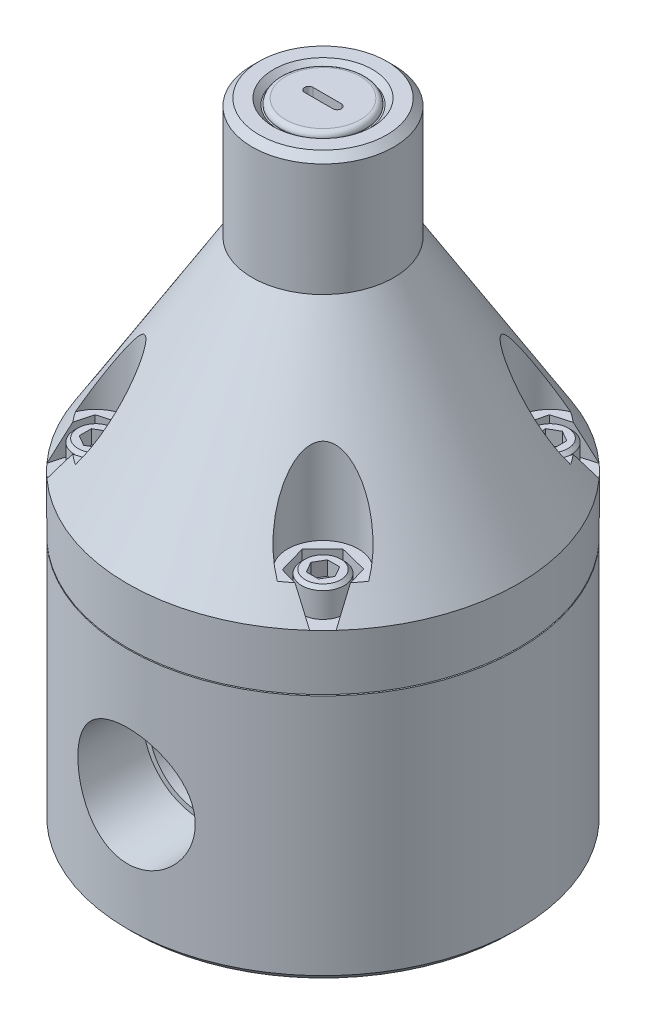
from build123d import *

# Parameters (mm, degrees)
SKETCH1_R         = 43.815
EXTRUDE1_DEPTH    = 140.97
SKETCH3_R         = 11.1125
EXTRUDE2_DEPTH    = 1.27
EXTRUDE2_DRAFT    = -45
CHAMFER1_SIZE     = 1.5748
SKETCH4_R         = 9.525
EXTRUDE3_DEPTH    = 1.27
FILLET1_R         = 1.143
EXTRUDE4_DEPTH    = 3.302
EXTRUDE4_DRAFT    = -1
SKETCH6_R         = 7.9375
EXTRUDE5_DEPTH    = 22.86
EXTRUDE6_DEPTH    = 6.35
CIRPATTERN1_COUNT = 4
SKETCH9_R         = 4.7625
EXTRUDE7_DEPTH    = 6.35
EXTRUDE8_DEPTH    = 3.175
CIRPATTERN2_COUNT = 4
CHAMFER2_SIZE     = 0.762


with BuildPart() as part:
    # Sketch1 → Extrude1 (new body)
    with BuildSketch(Plane(origin=(0, 0, 0), x_dir=(1, 0, 0), z_dir=(0, 1, 0))):
        with Locations(Location((0, 0, 0), (0, 0, 270))):
            Circle(SKETCH1_R)
    extrude(amount=EXTRUDE1_DEPTH)

    # Sketch2 → Cut-Revolve1 (revolve, cut)
    with BuildSketch(Plane.XY, mode=Mode.PRIVATE) as cut_revolve1_sk:
        Polygon((-43.815, 56.134), (-43.815, 68.58), (-15.875, 114.046), (-15.875, 147.034008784), (-49.44729897, 147.034008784), (-49.44729897, 55.88), (-30.226, 55.88), (-30.226, 56.134), align=None)
    revolve(cut_revolve1_sk.sketch.rotate(Axis((0, 0, 0), (0, 1, 0)), 270), axis=Axis((0, 0, 0), (0, 1, 0)), mode=Mode.SUBTRACT)


with BuildPart() as extrude2_tool:
    # Sketch3 → Extrude2 (with draft: the straight prism first)
    with BuildSketch(Plane(origin=(0, 140.97, 0), x_dir=(-1, 0, 0), z_dir=(0, 1, 0))):
        Circle(SKETCH3_R)
    extrude(amount=-EXTRUDE2_DEPTH)
    # Extrude2: the draft: its side faces are tilted about the plane it starts from
    extrude2_sides = [extrude2_tool.faces().sort_by_distance(p)[0] for p in [
        (11.1125, 140.335, 0),
    ]]
    draft(extrude2_sides, Plane(origin=(0, 140.97, 0), x_dir=(-1, 0, 0), z_dir=(0, 1, 0)), EXTRUDE2_DRAFT)


with BuildPart() as part_1:
    add(part.part)

    # Extrude2: cut by extrude2_tool
    add(extrude2_tool.part, mode=Mode.SUBTRACT)

    # Chamfer1
    chamfer1_edges = [part_1.edges().sort_by_distance(p)[0] for p in [
        (0, 0, -43.815),
        (0, 140.97, 15.875),
    ]]
    chamfer(chamfer1_edges, length=CHAMFER1_SIZE)

    # Sketch4 → Extrude3 (add)
    with BuildSketch(Plane(origin=(0, 140.97, 0), x_dir=(-1, 0, 0), z_dir=(0, 1, 0))):
        with Locations(Location((0, 0, 0), (0, 0, 90))):
            Circle(SKETCH4_R)
    extrude(amount=-EXTRUDE3_DEPTH)

    # Fillet1
    fillet1_edges = [part_1.edges().sort_by_distance(p)[0] for p in [
        (0, 140.97, -9.525),
    ]]
    fillet(fillet1_edges, radius=FILLET1_R)


with BuildPart() as extrude4_tool:
    # Sketch5 → Extrude4 (with draft: the straight prism first)
    with BuildSketch(Plane(origin=(0, 140.97, 0), x_dir=(-1, 0, 0), z_dir=(0, 1, 0))):
        with BuildLine():
            Line((3.175, 0.9652), (-3.175, 0.9652))
            ThreePointArc((-3.175, 0.9652), (-4.1402, 0), (-3.175, -0.9652))
            Line((-3.175, -0.9652), (3.175, -0.9652))
            ThreePointArc((3.175, -0.9652), (4.1402, 0), (3.175, 0.9652))
        make_face()
    extrude(amount=-EXTRUDE4_DEPTH)
    # Extrude4: the draft: its side faces are tilted about the plane it starts from
    extrude4_sides = [extrude4_tool.faces().sort_by_distance(p)[0] for p in [
        (-4.1402, 139.319, 0),
        (0, 139.319, 0.9652),
        (4.1402, 139.319, 0),
        (0, 139.319, -0.9652),
    ]]
    draft(extrude4_sides, Plane(origin=(0, 140.97, 0), x_dir=(-1, 0, 0), z_dir=(0, 1, 0)), EXTRUDE4_DRAFT)


with BuildPart() as part_2:
    add(part_1.part)

    # Extrude4: cut by extrude4_tool
    add(extrude4_tool.part, mode=Mode.SUBTRACT)

    # Sketch6 → Extrude5 (cut)
    with BuildSketch(Plane(origin=(0, 74.93, 0), x_dir=(-1, 0, 0), z_dir=(0, 1, 0))):
        with Locations((-25.459026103, 25.459026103)):
            Circle(SKETCH6_R)
    extrude5 = extrude(amount=EXTRUDE5_DEPTH, mode=Mode.SUBTRACT)

    # Sketch8 → Extrude6 (cut)
    with BuildSketch(Plane(origin=(0, 74.93, 0), x_dir=(-1, 0, 0), z_dir=(0, 1, 0))):
        Polygon((-29.948607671, 20.824591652), (-23.690278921, 19.253717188), (-19.200697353, 23.888151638), (-20.969444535, 30.093460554), (-33.591654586, 33.591654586), align=None)
    extrude6 = extrude(amount=-EXTRUDE6_DEPTH, mode=Mode.SUBTRACT)

    # CirPattern1: Extrude5, Extrude6 ×4 about axis
    cirpattern1_axis = Axis((0, 0, 0), (0, 1, 0))
    add([extrude5.rotate(cirpattern1_axis, i * 360 / CIRPATTERN1_COUNT) for i in range(1, CIRPATTERN1_COUNT)], mode=Mode.SUBTRACT)
    add([extrude6.rotate(cirpattern1_axis, i * 360 / CIRPATTERN1_COUNT) for i in range(1, CIRPATTERN1_COUNT)], mode=Mode.SUBTRACT)

    # Sketch9 → Extrude7 (add)
    with BuildSketch(Plane(origin=(0, 74.93, 0), x_dir=(-1, 0, 0), z_dir=(0, 1, 0))):
        with Locations(Location((-25.459026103, 25.459026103, 0), (0, 0, 90))):
            Circle(SKETCH9_R)
    extrude7 = extrude(amount=-EXTRUDE7_DEPTH)

    # Sketch10 → Extrude8 (cut)
    with BuildSketch(Plane(origin=(0, 74.93, 0), x_dir=(-1, 0, 0), z_dir=(0, 1, 0))):
        Polygon((-28.187127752, 25.459026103), (-26.823076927, 23.096420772), (-24.094975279, 23.096420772), (-22.730924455, 25.459026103), (-24.094975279, 27.821631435), (-26.823076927, 27.821631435), align=None)
    extrude8 = extrude(amount=-EXTRUDE8_DEPTH, mode=Mode.SUBTRACT)

    # CirPattern2: Extrude7, Extrude8 ×4 about axis
    cirpattern2_axis = Axis((0, 0, 0), (0, 1, 0))
    add([extrude7.rotate(cirpattern2_axis, i * 360 / CIRPATTERN2_COUNT) for i in range(1, CIRPATTERN2_COUNT)])
    add([extrude8.rotate(cirpattern2_axis, i * 360 / CIRPATTERN2_COUNT) for i in range(1, CIRPATTERN2_COUNT)], mode=Mode.SUBTRACT)

    # Chamfer2
    chamfer2_edges = [part_2.edges().sort_by_distance(p)[0] for p in [
        (25.459026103, 74.93, 20.696526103),
        (-20.696526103, 74.93, 25.459026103),
        (-25.459026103, 74.93, -20.696526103),
        (20.696526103, 74.93, -25.459026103),
    ]]
    chamfer(chamfer2_edges, length=CHAMFER2_SIZE)

    # Sketch14 → 3_4 Rc Tapped Hole2 (revolve, cut)
    with BuildSketch(Plane(origin=(0, 27.432, 43.815), x_dir=(0, -1, 0), z_dir=(1, 0, 0))):
        Polygon((0, 0), (0, 30.163455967), (11.5, 25.4), (11.5, 16.256), (12.711669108, 16.256), (13.2191265, 0), align=None)
    f_3_4_rc_tapped_hole2 = revolve(axis=Axis((0, 27.432, 50.165), (0, 0, -1)), mode=Mode.SUBTRACT)

    # Mirror1: 3_4 Rc Tapped Hole2 across plane
    add(f_3_4_rc_tapped_hole2.mirror(Plane.XY), mode=Mode.SUBTRACT)

    # Sketch17 → 3_4 Rc Tapped Hole3 (revolve, cut)
    with BuildSketch(Plane(origin=(0, 0, 0), x_dir=(0, 0, -1), z_dir=(1, 0, 0))):
        Polygon((0, 0), (0, 28.260096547), (4.76, 25.4), (4.76, 16.256), (12.711669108, 16.256), (13.2191265, 0), align=None)
    revolve(axis=Axis((0, -6.35, 0), (0, 1, 0)), mode=Mode.SUBTRACT)


solid = part_2.part
